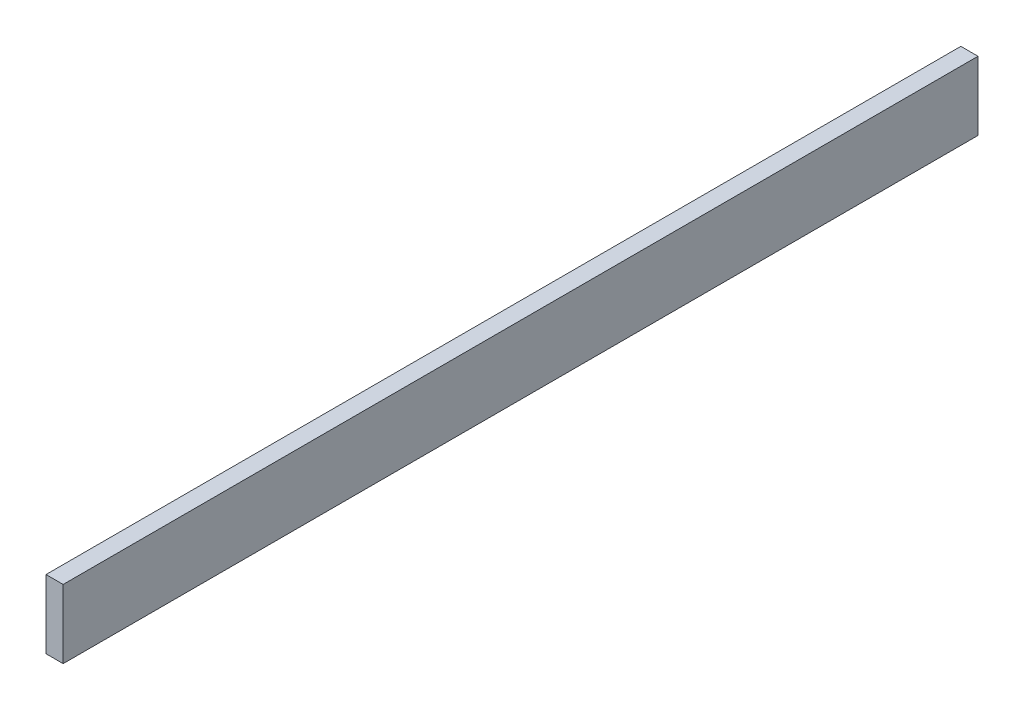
ISO-10303-21;
HEADER;
FILE_DESCRIPTION(('STEP AP214'),'2;1');
FILE_NAME('part.step','',(''),(''),'','','');
FILE_SCHEMA(('AUTOMOTIVE_DESIGN { 1 0 10303 214 1 1 1 1 }'));
ENDSEC;
DATA;
#1=APPLICATION_CONTEXT('core data for automotive mechanical design processes');
#2=APPLICATION_PROTOCOL_DEFINITION('international standard','automotive_design',2000,#1);
#3=PRODUCT_CONTEXT('',#1,'mechanical');
#4=PRODUCT('Part','Part','',(#3));
#5=PRODUCT_RELATED_PRODUCT_CATEGORY('part','',(#4));
#6=PRODUCT_DEFINITION_FORMATION('','',#4);
#7=PRODUCT_DEFINITION_CONTEXT('part definition',#1,'design');
#8=PRODUCT_DEFINITION('design','',#6,#7);
#9=PRODUCT_DEFINITION_SHAPE('','',#8);
#10=(LENGTH_UNIT() NAMED_UNIT(*) SI_UNIT(.MILLI.,.METRE.));
#11=(NAMED_UNIT(*) PLANE_ANGLE_UNIT() SI_UNIT($,.RADIAN.));
#12=(NAMED_UNIT(*) SI_UNIT($,.STERADIAN.) SOLID_ANGLE_UNIT());
#13=UNCERTAINTY_MEASURE_WITH_UNIT(LENGTH_MEASURE(1.E-05),#10,'distance_accuracy_value','');
#14=(GEOMETRIC_REPRESENTATION_CONTEXT(3) GLOBAL_UNCERTAINTY_ASSIGNED_CONTEXT((#13)) GLOBAL_UNIT_ASSIGNED_CONTEXT((#10,
#11,#12)) REPRESENTATION_CONTEXT('',''));
#15=CARTESIAN_POINT('',(0.,0.,0.));
#16=DIRECTION('',(0.,0.,1.));
#17=DIRECTION('',(1.,0.,0.));
#18=AXIS2_PLACEMENT_3D('',#15,#16,#17);
#19=CARTESIAN_POINT('',(1.5,-3.00000000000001,40.));
#20=DIRECTION('',(0.,0.,-1.));
#21=DIRECTION('',(-1.,0.,0.));
#22=AXIS2_PLACEMENT_3D('',#19,#20,#21);
#23=PLANE('',#22);
#24=DIRECTION('',(0.,-1.,0.));
#25=VECTOR('',#24,1.);
#26=CARTESIAN_POINT('',(0.,-3.00000000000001,40.));
#27=LINE('',#26,#25);
#28=CARTESIAN_POINT('',(0.,2.99999999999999,40.));
#29=VERTEX_POINT('',#28);
#30=CARTESIAN_POINT('',(0.,-3.00000000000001,40.));
#31=VERTEX_POINT('',#30);
#32=EDGE_CURVE('E96',#29,#31,#27,.T.);
#33=ORIENTED_EDGE('',*,*,#32,.T.);
#34=DIRECTION('',(-1.,0.,0.));
#35=VECTOR('',#34,1.);
#36=CARTESIAN_POINT('',(1.5,-3.00000000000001,40.));
#37=LINE('',#36,#35);
#38=CARTESIAN_POINT('',(1.5,-3.00000000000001,40.));
#39=VERTEX_POINT('',#38);
#40=EDGE_CURVE('E11',#39,#31,#37,.T.);
#41=ORIENTED_EDGE('',*,*,#40,.F.);
#42=DIRECTION('',(0.,-1.,0.));
#43=VECTOR('',#42,1.);
#44=CARTESIAN_POINT('',(1.5,-3.00000000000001,40.));
#45=LINE('',#44,#43);
#46=CARTESIAN_POINT('',(1.5,2.99999999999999,40.));
#47=VERTEX_POINT('',#46);
#48=EDGE_CURVE('E84',#47,#39,#45,.T.);
#49=ORIENTED_EDGE('',*,*,#48,.F.);
#50=DIRECTION('',(-1.,0.,0.));
#51=VECTOR('',#50,1.);
#52=CARTESIAN_POINT('',(1.5,2.99999999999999,40.));
#53=LINE('',#52,#51);
#54=EDGE_CURVE('E92',#47,#29,#53,.T.);
#55=ORIENTED_EDGE('',*,*,#54,.T.);
#56=EDGE_LOOP('',(#33,#41,#49,#55));
#57=FACE_BOUND('',#56,.T.);
#58=ADVANCED_FACE('F33',(#57),#23,.F.);
#59=CARTESIAN_POINT('',(1.5,-3.,-40.));
#60=DIRECTION('',(0.,1.,0.));
#61=DIRECTION('',(0.,0.,1.));
#62=AXIS2_PLACEMENT_3D('',#59,#60,#61);
#63=PLANE('',#62);
#64=DIRECTION('',(0.,0.,-1.));
#65=VECTOR('',#64,1.);
#66=CARTESIAN_POINT('',(0.,-3.,-40.));
#67=LINE('',#66,#65);
#68=CARTESIAN_POINT('',(0.,-3.,-40.));
#69=VERTEX_POINT('',#68);
#70=EDGE_CURVE('E88',#31,#69,#67,.T.);
#71=ORIENTED_EDGE('',*,*,#70,.T.);
#72=DIRECTION('',(-1.,0.,0.));
#73=VECTOR('',#72,1.);
#74=CARTESIAN_POINT('',(1.5,-3.,-40.));
#75=LINE('',#74,#73);
#76=CARTESIAN_POINT('',(1.5,-3.,-40.));
#77=VERTEX_POINT('',#76);
#78=EDGE_CURVE('E41',#77,#69,#75,.T.);
#79=ORIENTED_EDGE('',*,*,#78,.F.);
#80=DIRECTION('',(0.,0.,-1.));
#81=VECTOR('',#80,1.);
#82=CARTESIAN_POINT('',(1.5,-3.,-40.));
#83=LINE('',#82,#81);
#84=EDGE_CURVE('E79',#39,#77,#83,.T.);
#85=ORIENTED_EDGE('',*,*,#84,.F.);
#86=ORIENTED_EDGE('',*,*,#40,.T.);
#87=EDGE_LOOP('',(#71,#79,#85,#86));
#88=FACE_BOUND('',#87,.T.);
#89=ADVANCED_FACE('F87',(#88),#63,.F.);
#90=CARTESIAN_POINT('',(1.5,-3.,-40.));
#91=DIRECTION('',(0.,0.,1.));
#92=DIRECTION('',(1.,0.,0.));
#93=AXIS2_PLACEMENT_3D('',#90,#91,#92);
#94=PLANE('',#93);
#95=DIRECTION('',(0.,1.,0.));
#96=VECTOR('',#95,1.);
#97=CARTESIAN_POINT('',(0.,-3.,-40.));
#98=LINE('',#97,#96);
#99=CARTESIAN_POINT('',(0.,3.,-40.));
#100=VERTEX_POINT('',#99);
#101=EDGE_CURVE('E66',#69,#100,#98,.T.);
#102=ORIENTED_EDGE('',*,*,#101,.T.);
#103=DIRECTION('',(-1.,0.,0.));
#104=VECTOR('',#103,1.);
#105=CARTESIAN_POINT('',(1.5,3.,-40.));
#106=LINE('',#105,#104);
#107=CARTESIAN_POINT('',(1.5,3.,-40.));
#108=VERTEX_POINT('',#107);
#109=EDGE_CURVE('E89',#108,#100,#106,.T.);
#110=ORIENTED_EDGE('',*,*,#109,.F.);
#111=DIRECTION('',(0.,1.,0.));
#112=VECTOR('',#111,1.);
#113=CARTESIAN_POINT('',(1.5,-3.,-40.));
#114=LINE('',#113,#112);
#115=EDGE_CURVE('E82',#77,#108,#114,.T.);
#116=ORIENTED_EDGE('',*,*,#115,.F.);
#117=ORIENTED_EDGE('',*,*,#78,.T.);
#118=EDGE_LOOP('',(#102,#110,#116,#117));
#119=FACE_BOUND('',#118,.T.);
#120=ADVANCED_FACE('F90',(#119),#94,.F.);
#121=CARTESIAN_POINT('',(1.5,3.,-40.));
#122=DIRECTION('',(0.,-1.,0.));
#123=DIRECTION('',(0.,0.,-1.));
#124=AXIS2_PLACEMENT_3D('',#121,#122,#123);
#125=PLANE('',#124);
#126=DIRECTION('',(0.,0.,1.));
#127=VECTOR('',#126,1.);
#128=CARTESIAN_POINT('',(0.,3.,-40.));
#129=LINE('',#128,#127);
#130=EDGE_CURVE('E72',#100,#29,#129,.T.);
#131=ORIENTED_EDGE('',*,*,#130,.T.);
#132=ORIENTED_EDGE('',*,*,#54,.F.);
#133=DIRECTION('',(0.,0.,1.));
#134=VECTOR('',#133,1.);
#135=CARTESIAN_POINT('',(1.5,3.,-40.));
#136=LINE('',#135,#134);
#137=EDGE_CURVE('E49',#108,#47,#136,.T.);
#138=ORIENTED_EDGE('',*,*,#137,.F.);
#139=ORIENTED_EDGE('',*,*,#109,.T.);
#140=EDGE_LOOP('',(#131,#132,#138,#139));
#141=FACE_BOUND('',#140,.T.);
#142=ADVANCED_FACE('F103',(#141),#125,.F.);
#143=CARTESIAN_POINT('',(1.5,0.,0.));
#144=DIRECTION('',(1.,0.,0.));
#145=DIRECTION('',(0.,0.,-1.));
#146=AXIS2_PLACEMENT_3D('',#143,#144,#145);
#147=PLANE('',#146);
#148=ORIENTED_EDGE('',*,*,#48,.T.);
#149=ORIENTED_EDGE('',*,*,#84,.T.);
#150=ORIENTED_EDGE('',*,*,#115,.T.);
#151=ORIENTED_EDGE('',*,*,#137,.T.);
#152=EDGE_LOOP('',(#148,#149,#150,#151));
#153=FACE_BOUND('',#152,.T.);
#154=ADVANCED_FACE('F80',(#153),#147,.T.);
#155=CARTESIAN_POINT('',(0.,0.,0.));
#156=DIRECTION('',(1.,0.,0.));
#157=DIRECTION('',(0.,0.,-1.));
#158=AXIS2_PLACEMENT_3D('',#155,#156,#157);
#159=PLANE('',#158);
#160=ORIENTED_EDGE('',*,*,#32,.F.);
#161=ORIENTED_EDGE('',*,*,#130,.F.);
#162=ORIENTED_EDGE('',*,*,#101,.F.);
#163=ORIENTED_EDGE('',*,*,#70,.F.);
#164=EDGE_LOOP('',(#160,#161,#162,#163));
#165=FACE_BOUND('',#164,.T.);
#166=ADVANCED_FACE('F106',(#165),#159,.F.);
#167=CLOSED_SHELL('',(#58,#89,#120,#142,#154,#166));
#168=MANIFOLD_SOLID_BREP('B2',#167);
#169=ADVANCED_BREP_SHAPE_REPRESENTATION('',(#18,#168),#14);
#170=SHAPE_DEFINITION_REPRESENTATION(#9,#169);
ENDSEC;
END-ISO-10303-21;
